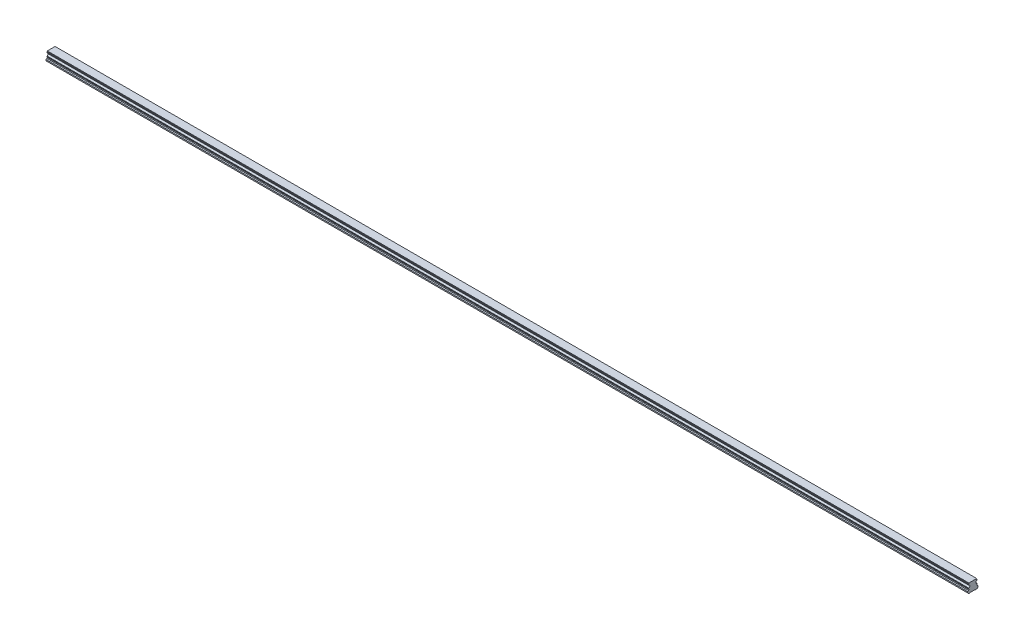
from build123d import *

# Parameters (mm, degrees)
BOSS_EXTRUDE1_DEPTH        = 2220
SKETCH3_R                  = 3
SKETCH3_R_2                = 2.5
CUT_EXTRUDE3_DEPTH         = 12
SKETCH3_2_R                = 2.5
CUT_EXTRUDE4_DEPTH         = 15
CHAMFER1_SIZE              = 0.5
LPATTERN4_COUNT            = 37
LPATTERN4_PITCH            = 60
CHAMFER1_OF_LPATTERN4_SIZE = 0.5


with BuildPart() as part:
    # Sketch1 → Boss-Extrude1 (new body)
    with BuildSketch(Plane(origin=(0, 0, 0), x_dir=(0, 0, -1), z_dir=(1, 0, 0))):
        with BuildLine():
            Line((9.375, 21.8), (-9.375, 21.8))
            Line((-9.375, 21.8), (-9.375, 20.756))
            Line((-9.375, 20.756), (-10, 19.415683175))
            Line((-10, 19.415683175), (-10, 17.685449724))
            ThreePointArc((-10, 17.685449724), (-7.2, 14.6), (-10, 11.514550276))
            Line((-10, 11.514550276), (-10, 9.784316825))
            Line((-10, 9.784316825), (-9.375, 8.444))
            Line((-9.375, 8.444), (-9.922688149, 6.4))
            Line((-9.922688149, 6.4), (-12.5, 5.489338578))
            Line((-12.5, 5.489338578), (-12.5, 2.65))
            Line((-12.5, 2.65), (-9.85, 0))
            Line((-9.85, 0), (-5.5, 0))
            Line((-5.5, 0), (-5, 0.5))
            Line((-5, 0.5), (5, 0.5))
            Line((5, 0.5), (5.5, 0))
            Line((5.5, 0), (9.85, 0))
            Line((9.85, 0), (12.5, 2.65))
            Line((12.5, 2.65), (12.5, 5.489338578))
            Line((12.5, 5.489338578), (9.922688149, 6.4))
            Line((9.922688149, 6.4), (9.375, 8.444))
            Line((9.375, 8.444), (10, 9.784316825))
            Line((10, 9.784316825), (10, 11.514550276))
            ThreePointArc((10, 11.514550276), (7.2, 14.6), (10, 17.685449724))
            Line((10, 17.685449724), (10, 19.415683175))
            Line((10, 19.415683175), (9.375, 20.756))
            Line((9.375, 20.756), (9.375, 21.8))
        make_face()
    extrude(amount=BOSS_EXTRUDE1_DEPTH)

    # Sketch3 → Cut-Extrude3 (cut)
    with BuildSketch(Plane.XZ):
        with Locations(Location((30, 0, 0), (0, 0, 270))):
            Circle(SKETCH3_R)
        with Locations(Location((30, 0, 0), (0, 0, 270))):
            Circle(SKETCH3_R_2, mode=Mode.SUBTRACT)
    cut_extrude3 = extrude(amount=-CUT_EXTRUDE3_DEPTH, mode=Mode.SUBTRACT)

    # Sketch3_2 → Cut-Extrude4 (cut)
    with BuildSketch(Plane.XZ):
        with Locations(Location((30, 0, 0), (0, 0, 270))):
            Circle(SKETCH3_2_R)
    cut_extrude4 = extrude(amount=-CUT_EXTRUDE4_DEPTH, mode=Mode.SUBTRACT)

    # Cut-Extrude5 cone 1 section (on through the dimple's axis) → Cut-Extrude5 (revolve, cut)
    with BuildSketch(Plane(origin=(30, 15, 0), x_dir=(0, 0, -1), z_dir=(1, 0, 0))):
        Polygon((0, 0), (2.5, 0), (0, 1.443375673), align=None)
    cut_extrude5 = revolve(axis=Axis((30, 15, 0), (0, 1, 0)), mode=Mode.SUBTRACT)

    # Chamfer1
    chamfer1_edges = [part.edges().sort_by_distance(p)[0] for p in [
        (30, 0.5, 3),
    ]]
    chamfer(chamfer1_edges, length=CHAMFER1_SIZE)

    # LPattern4: Cut-Extrude3, Cut-Extrude4, Cut-Extrude5 ×37
    with Locations(*[(i * LPATTERN4_PITCH, 0, 0) for i in range(1, LPATTERN4_COUNT)]):
        add(cut_extrude3, mode=Mode.SUBTRACT)
        add(cut_extrude4, mode=Mode.SUBTRACT)
        add(cut_extrude5, mode=Mode.SUBTRACT)

    # Chamfer1 of LPattern4
    chamfer1_of_lpattern4_edges = [part.edges().sort_by_distance(p)[0] for p in [
        (90, 0.5, 3),
        (150, 0.5, 3),
        (210, 0.5, 3),
        (270, 0.5, 3),
        (330, 0.5, 3),
        (390, 0.5, 3),
        (450, 0.5, 3),
        (510, 0.5, 3),
        (570, 0.5, 3),
        (630, 0.5, 3),
        (690, 0.5, 3),
        (750, 0.5, 3),
        (810, 0.5, 3),
        (870, 0.5, 3),
        (930, 0.5, 3),
        (990, 0.5, 3),
        (1050, 0.5, 3),
        (1110, 0.5, 3),
        (1170, 0.5, 3),
        (1230, 0.5, 3),
        (1290, 0.5, 3),
        (1350, 0.5, 3),
        (1410, 0.5, 3),
        (1470, 0.5, 3),
        (1530, 0.5, 3),
        (1590, 0.5, 3),
        (1650, 0.5, 3),
        (1710, 0.5, 3),
        (1770, 0.5, 3),
        (1830, 0.5, 3),
        (1890, 0.5, 3),
        (1950, 0.5, 3),
        (2010, 0.5, 3),
        (2070, 0.5, 3),
        (2130, 0.5, 3),
        (2190, 0.5, 3),
    ]]
    chamfer(chamfer1_of_lpattern4_edges, length=CHAMFER1_OF_LPATTERN4_SIZE)


solid = part.part
